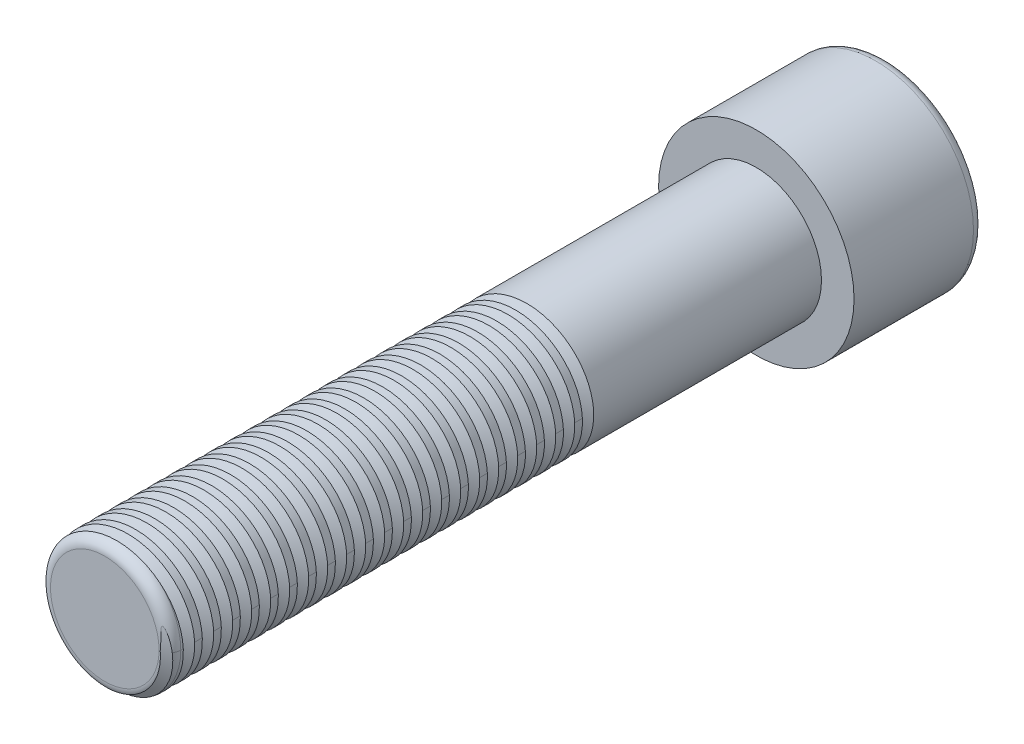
from build123d import *

# Parameters (mm, degrees)
SKETCH_1_R          = 9
EXTRUDE_1_DEPTH     = 12
SKETCH_2_R          = 6
EXTRUDE_2_DEPTH     = 60
FILLET_1_R          = 1
SWEEP_1_PITCH       = 1.75
SWEEP_1_HEIGHT      = 40
SWEEP_1_RADIUS      = 5.1
SWEEP_1_START_ANGLE = -45
CUT_EXTRUDE_1_DEPTH = 6


with BuildPart() as part:
    # Sketch 1 → Extrude 1 (new body)
    with BuildSketch(Plane.XY):
        Circle(SKETCH_1_R)
    extrude(amount=EXTRUDE_1_DEPTH)

    # Sketch 2 → Extrude 2 (add)
    with BuildSketch(Plane.XY.offset(12)):
        Circle(SKETCH_2_R)
    extrude(amount=EXTRUDE_2_DEPTH)

    # Fillet 1
    fillet_1_edges = [part.edges().sort_by_distance(p)[0] for p in [
        (-9, 0, 0),
        (-6, 0, 72),
    ]]
    fillet(fillet_1_edges, radius=FILLET_1_R)

    # Sweep 1: sweep along a helix
    with BuildLine() as sweep_1_path:
        add(Helix(SWEEP_1_PITCH, SWEEP_1_HEIGHT, SWEEP_1_RADIUS, center=(0, 0, 72), direction=(0, 0, -1), mode=Mode.PRIVATE).rotate(Axis((0, 0, 72), (0, 0, -1)), SWEEP_1_START_ANGLE))
    # Sketch 4 → Sweep 1 (sweep, cut)
    with BuildSketch(Plane(origin=(0, 0, 0), x_dir=(1, 0, 0), z_dir=(0, 1, 0))):
        Polygon((5.099899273, -71.994997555), (6.453196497, -72.786328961), (6.461860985, -71.218673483), align=None)
    sweep(path=sweep_1_path.line, is_frenet=True, mode=Mode.SUBTRACT)

    # Sketch 5 → Cut-Extrude 1 (cut)
    with BuildSketch(Plane(origin=(0, 0, 0), x_dir=(-1, 0, 0), z_dir=(0, 0, -1))):
        Polygon((3.27163036, -4.757075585), (5.755563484, 0.454777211), (2.483933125, 5.211852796), (-3.27163036, 4.757075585), (-5.755563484, -0.454777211), (-2.483933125, -5.211852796), align=None)
    extrude(amount=-CUT_EXTRUDE_1_DEPTH, mode=Mode.SUBTRACT)


solid = part.part
